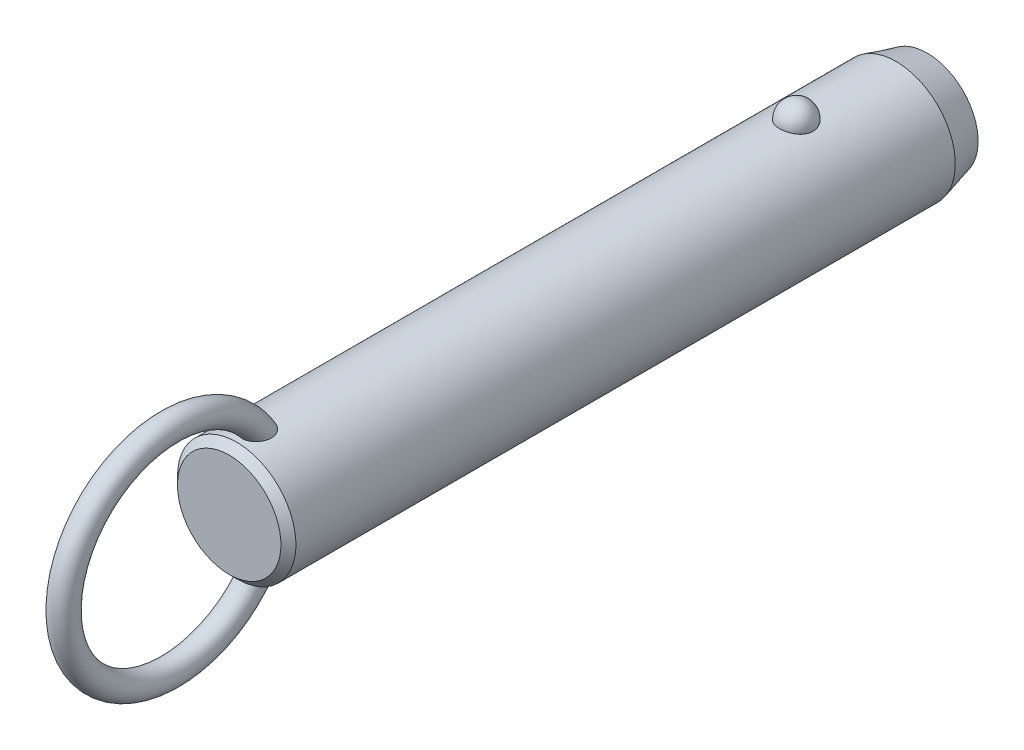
ISO-10303-21;
HEADER;
FILE_DESCRIPTION(('STEP AP214'),'2;1');
FILE_NAME('part.step','',(''),(''),'','','');
FILE_SCHEMA(('AUTOMOTIVE_DESIGN { 1 0 10303 214 1 1 1 1 }'));
ENDSEC;
DATA;
#1=APPLICATION_CONTEXT('core data for automotive mechanical design processes');
#2=APPLICATION_PROTOCOL_DEFINITION('international standard','automotive_design',2000,#1);
#3=PRODUCT_CONTEXT('',#1,'mechanical');
#4=PRODUCT('Part','Part','',(#3));
#5=PRODUCT_RELATED_PRODUCT_CATEGORY('part','',(#4));
#6=PRODUCT_DEFINITION_FORMATION('','',#4);
#7=PRODUCT_DEFINITION_CONTEXT('part definition',#1,'design');
#8=PRODUCT_DEFINITION('design','',#6,#7);
#9=PRODUCT_DEFINITION_SHAPE('','',#8);
#10=(LENGTH_UNIT() NAMED_UNIT(*) SI_UNIT(.MILLI.,.METRE.));
#11=(NAMED_UNIT(*) PLANE_ANGLE_UNIT() SI_UNIT($,.RADIAN.));
#12=(NAMED_UNIT(*) SI_UNIT($,.STERADIAN.) SOLID_ANGLE_UNIT());
#13=UNCERTAINTY_MEASURE_WITH_UNIT(LENGTH_MEASURE(1.E-05),#10,'distance_accuracy_value','');
#14=(GEOMETRIC_REPRESENTATION_CONTEXT(3) GLOBAL_UNCERTAINTY_ASSIGNED_CONTEXT((#13)) GLOBAL_UNIT_ASSIGNED_CONTEXT((#10,
#11,#12)) REPRESENTATION_CONTEXT('',''));
#15=CARTESIAN_POINT('',(0.,0.,0.));
#16=DIRECTION('',(0.,0.,1.));
#17=DIRECTION('',(1.,0.,0.));
#18=AXIS2_PLACEMENT_3D('',#15,#16,#17);
#19=CARTESIAN_POINT('',(0.,0.,78.8));
#20=DIRECTION('',(0.,0.,-1.));
#21=DIRECTION('',(-1.,0.,0.));
#22=AXIS2_PLACEMENT_3D('',#19,#20,#21);
#23=CYLINDRICAL_SURFACE('',#22,9.5);
#24=CARTESIAN_POINT('',(2.67259918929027,9.11631578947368,-2.7));
#25=CARTESIAN_POINT('',(2.6725968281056,9.11631786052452,-2.54909854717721));
#26=CARTESIAN_POINT('',(2.66030567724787,9.11994722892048,-2.39816735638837));
#27=CARTESIAN_POINT('',(2.6114347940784,9.13405924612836,-2.10058568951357));
#28=CARTESIAN_POINT('',(2.57484658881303,9.14454428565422,-1.9539367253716));
#29=CARTESIAN_POINT('',(2.47830875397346,9.17117631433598,-1.66916069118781));
#30=CARTESIAN_POINT('',(2.41836936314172,9.18732082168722,-1.53102991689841));
#31=CARTESIAN_POINT('',(2.27661331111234,9.22346780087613,-1.26705393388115));
#32=CARTESIAN_POINT('',(2.19479699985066,9.24347021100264,-1.14120852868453));
#33=CARTESIAN_POINT('',(2.01085282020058,9.28522401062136,-0.904632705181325));
#34=CARTESIAN_POINT('',(1.90862396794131,9.30698376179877,-0.793982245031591));
#35=CARTESIAN_POINT('',(1.6867437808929,9.34973971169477,-0.59160721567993));
#36=CARTESIAN_POINT('',(1.56709244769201,9.37073591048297,-0.499882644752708));
#37=CARTESIAN_POINT('',(1.31393976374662,9.40956370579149,-0.338167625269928));
#38=CARTESIAN_POINT('',(1.18048026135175,9.42740444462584,-0.268113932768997));
#39=CARTESIAN_POINT('',(0.903154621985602,9.45799906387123,-0.151390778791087));
#40=CARTESIAN_POINT('',(0.759289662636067,9.47075351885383,-0.104718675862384));
#41=CARTESIAN_POINT('',(0.468074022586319,9.48956256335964,-0.0367633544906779));
#42=CARTESIAN_POINT('',(0.320836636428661,9.49573643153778,-0.0150275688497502));
#43=CARTESIAN_POINT('',(0.0246714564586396,9.50112183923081,0.00396199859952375));
#44=CARTESIAN_POINT('',(-0.124256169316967,9.50033406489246,0.00121819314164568));
#45=CARTESIAN_POINT('',(-0.417264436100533,9.4919475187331,-0.0284441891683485));
#46=CARTESIAN_POINT('',(-0.561384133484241,9.48444885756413,-0.0550074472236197));
#47=CARTESIAN_POINT('',(-0.842986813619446,9.46357853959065,-0.131064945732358));
#48=CARTESIAN_POINT('',(-0.98046968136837,9.450206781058,-0.180559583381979));
#49=CARTESIAN_POINT('',(-1.24585005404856,9.41890822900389,-0.301476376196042));
#50=CARTESIAN_POINT('',(-1.37368611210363,9.40095498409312,-0.373026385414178));
#51=CARTESIAN_POINT('',(-1.61552738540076,9.3624296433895,-0.536025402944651));
#52=CARTESIAN_POINT('',(-1.72953116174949,9.34185727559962,-0.62747647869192));
#53=CARTESIAN_POINT('',(-1.9429225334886,9.29984568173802,-0.829844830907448));
#54=CARTESIAN_POINT('',(-2.04198021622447,9.27839736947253,-0.941108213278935));
#55=CARTESIAN_POINT('',(-2.2202646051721,9.23735994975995,-1.17883414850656));
#56=CARTESIAN_POINT('',(-2.29948985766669,9.21777097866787,-1.30529781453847));
#57=CARTESIAN_POINT('',(-2.43697287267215,9.18238994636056,-1.57158566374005));
#58=CARTESIAN_POINT('',(-2.49497068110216,9.16664569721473,-1.71155057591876));
#59=CARTESIAN_POINT('',(-2.5872073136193,9.14104303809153,-1.99961197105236));
#60=CARTESIAN_POINT('',(-2.62144683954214,9.13118445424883,-2.14770821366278));
#61=CARTESIAN_POINT('',(-2.66521466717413,9.11850622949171,-2.44715424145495));
#62=CARTESIAN_POINT('',(-2.67484831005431,9.11565658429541,-2.59848735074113));
#63=CARTESIAN_POINT('',(-2.66946735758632,9.11723375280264,-2.90067317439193));
#64=CARTESIAN_POINT('',(-2.65445345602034,9.12166036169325,-3.05152590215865));
#65=CARTESIAN_POINT('',(-2.6002971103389,9.13724422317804,-3.34766110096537));
#66=CARTESIAN_POINT('',(-2.56127978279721,9.14836656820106,-3.49296833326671));
#67=CARTESIAN_POINT('',(-2.46018844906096,9.17606676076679,-3.77477535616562));
#68=CARTESIAN_POINT('',(-2.39811349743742,9.19264483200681,-3.9112747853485));
#69=CARTESIAN_POINT('',(-2.25202303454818,9.22952198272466,-4.17244273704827));
#70=CARTESIAN_POINT('',(-2.16788714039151,9.24984129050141,-4.29704106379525));
#71=CARTESIAN_POINT('',(-1.9799408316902,9.29188255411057,-4.53013066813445));
#72=CARTESIAN_POINT('',(-1.87612963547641,9.31360456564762,-4.63862130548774));
#73=CARTESIAN_POINT('',(-1.65105429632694,9.35612959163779,-4.8369029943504));
#74=CARTESIAN_POINT('',(-1.52972405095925,9.37692871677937,-4.92661991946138));
#75=CARTESIAN_POINT('',(-1.27318250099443,9.41518970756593,-5.08429106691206));
#76=CARTESIAN_POINT('',(-1.13797219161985,9.432651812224,-5.15224684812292));
#77=CARTESIAN_POINT('',(-0.859280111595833,9.46208255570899,-5.26371827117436));
#78=CARTESIAN_POINT('',(-0.715925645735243,9.47411833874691,-5.30753421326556));
#79=CARTESIAN_POINT('',(-0.423550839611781,9.4916822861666,-5.37076321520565));
#80=CARTESIAN_POINT('',(-0.274531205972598,9.49721125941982,-5.39017930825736));
#81=CARTESIAN_POINT('',(0.0218446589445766,9.50110860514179,-5.40390587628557));
#82=CARTESIAN_POINT('',(0.169177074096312,9.49961381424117,-5.39869609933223));
#83=CARTESIAN_POINT('',(0.460808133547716,9.48993906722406,-5.3644195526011));
#84=CARTESIAN_POINT('',(0.605106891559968,9.48175936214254,-5.33535367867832));
#85=CARTESIAN_POINT('',(0.886027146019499,9.4596376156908,-5.2543558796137));
#86=CARTESIAN_POINT('',(1.02267710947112,9.44571881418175,-5.20251612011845));
#87=CARTESIAN_POINT('',(1.28523827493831,9.41358993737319,-5.07741549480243));
#88=CARTESIAN_POINT('',(1.41114877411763,9.39537958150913,-5.0041532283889));
#89=CARTESIAN_POINT('',(1.65085227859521,9.3562644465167,-4.83684599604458));
#90=CARTESIAN_POINT('',(1.76442346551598,9.33532178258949,-4.74249218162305));
#91=CARTESIAN_POINT('',(1.97425672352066,9.29321198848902,-4.53620389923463));
#92=CARTESIAN_POINT('',(2.07051582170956,9.27204482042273,-4.42426641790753));
#93=CARTESIAN_POINT('',(2.24490086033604,9.23139221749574,-4.18363183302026));
#94=CARTESIAN_POINT('',(2.32267019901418,9.21194380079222,-4.05466990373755));
#95=CARTESIAN_POINT('',(2.45584092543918,9.1773419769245,-3.78517836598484));
#96=CARTESIAN_POINT('',(2.51124979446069,9.16218713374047,-3.64465264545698));
#97=CARTESIAN_POINT('',(2.59380876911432,9.13913522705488,-3.37104301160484));
#98=CARTESIAN_POINT('',(2.62330266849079,9.13064624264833,-3.23871053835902));
#99=CARTESIAN_POINT('',(2.66269870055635,9.11923566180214,-2.97092664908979));
#100=CARTESIAN_POINT('',(2.67260130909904,9.11631393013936,-2.8354753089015));
#101=CARTESIAN_POINT('',(2.67259918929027,9.11631578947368,-2.7));
#102=B_SPLINE_CURVE_WITH_KNOTS('',3,(#24,#25,#26,#27,#28,#29,#30,#31,#32,#33,#34,#35,#36,#37,
#38,#39,#40,#41,#42,#43,#44,#45,#46,#47,#48,#49,#50,#51,#52,#53,#54,#55,#56,#57,#58,#59,#60,#61,
#62,#63,#64,#65,#66,#67,#68,#69,#70,#71,#72,#73,#74,#75,#76,#77,#78,#79,#80,#81,#82,#83,#84,#85,
#86,#87,#88,#89,#90,#91,#92,#93,#94,#95,#96,#97,#98,#99,#100,#101),.UNSPECIFIED.,.T.,.F.,(4,2,2,
2,2,2,2,2,2,2,2,2,2,2,2,2,2,2,2,2,2,2,2,2,2,2,2,2,2,2,2,2,2,2,2,2,2,2,4),(0.,0.452217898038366,
0.904593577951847,1.35677112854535,1.80894144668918,2.26340676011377,2.71787203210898,
3.17099820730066,3.62407318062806,4.0687883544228,4.51345969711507,4.95160616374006,
5.38976021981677,5.83050358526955,6.27129275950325,6.72071308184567,7.17016633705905,
7.62495278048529,8.07972578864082,8.53254856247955,8.98535859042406,9.43582813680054,
9.88631615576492,10.3393155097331,10.7923328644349,11.2471065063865,11.7018475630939,
12.1507959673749,12.5996885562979,13.0398725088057,13.4800399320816,13.9184421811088,
14.3568730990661,14.802202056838,15.2476074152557,15.7010097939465,16.1542603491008,
16.5602594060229,16.9662486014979),.UNSPECIFIED.);
#103=CARTESIAN_POINT('',(2.67259918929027,9.11631578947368,-2.7));
#104=VERTEX_POINT('',#103);
#105=EDGE_CURVE('E41',#104,#104,#102,.T.);
#106=ORIENTED_EDGE('',*,*,#105,.T.);
#107=EDGE_LOOP('',(#106));
#108=FACE_BOUND('',#107,.T.);
#109=CARTESIAN_POINT('',(0.,0.,87.12));
#110=DIRECTION('',(0.,0.,1.));
#111=DIRECTION('',(1.,0.,0.));
#112=AXIS2_PLACEMENT_3D('',#109,#110,#111);
#113=CIRCLE('',#112,9.5);
#114=CARTESIAN_POINT('',(-9.50000000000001,0.,87.12));
#115=VERTEX_POINT('',#114);
#116=EDGE_CURVE('E10',#115,#115,#113,.F.);
#117=ORIENTED_EDGE('',*,*,#116,.T.);
#118=EDGE_LOOP('',(#117));
#119=FACE_BOUND('',#118,.T.);
#120=CARTESIAN_POINT('',(-0.697062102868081,-9.47439269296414,81.4678088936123));
#121=CARTESIAN_POINT('',(-0.799579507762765,-9.46685146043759,81.5074823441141));
#122=CARTESIAN_POINT('',(-0.898575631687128,-9.45788043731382,81.5559309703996));
#123=CARTESIAN_POINT('',(-1.08670047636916,-9.43811593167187,81.6688685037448));
#124=CARTESIAN_POINT('',(-1.17583204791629,-9.42732297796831,81.7333527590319));
#125=CARTESIAN_POINT('',(-1.34179806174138,-9.40513672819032,81.8762099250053));
#126=CARTESIAN_POINT('',(-1.41865133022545,-9.39374438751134,81.954561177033));
#127=CARTESIAN_POINT('',(-1.5586004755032,-9.37154196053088,82.1227524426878));
#128=CARTESIAN_POINT('',(-1.62169476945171,-9.3607319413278,82.2125937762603));
#129=CARTESIAN_POINT('',(-1.73527695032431,-9.34035749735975,82.4045001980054));
#130=CARTESIAN_POINT('',(-1.7852226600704,-9.33085270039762,82.5068910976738));
#131=CARTESIAN_POINT('',(-1.86924997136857,-9.3143834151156,82.718148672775));
#132=CARTESIAN_POINT('',(-1.90332570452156,-9.30741986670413,82.8270177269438));
#133=CARTESIAN_POINT('',(-1.95893603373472,-9.29588482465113,83.0604730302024));
#134=CARTESIAN_POINT('',(-1.97872420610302,-9.29165182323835,83.1854890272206));
#135=CARTESIAN_POINT('',(-2.00062129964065,-9.28695978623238,83.4370805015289));
#136=CARTESIAN_POINT('',(-2.00272284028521,-9.28650232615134,83.563656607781));
#137=CARTESIAN_POINT('',(-1.98958876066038,-9.28932750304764,83.8368157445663));
#138=CARTESIAN_POINT('',(-1.97143366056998,-9.2932400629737,83.9832519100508));
#139=CARTESIAN_POINT('',(-1.91479925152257,-9.30507151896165,84.2720629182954));
#140=CARTESIAN_POINT('',(-1.87629122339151,-9.31299607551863,84.414431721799));
#141=CARTESIAN_POINT('',(-1.77225683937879,-9.33340232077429,84.7151725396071));
#142=CARTESIAN_POINT('',(-1.70334898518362,-9.34641636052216,84.8723691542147));
#143=CARTESIAN_POINT('',(-1.58111062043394,-9.36759153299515,85.0975171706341));
#144=CARTESIAN_POINT('',(-1.53721459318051,-9.37492619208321,85.1707968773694));
#145=CARTESIAN_POINT('',(-1.44302631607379,-9.38988566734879,85.3130740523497));
#146=CARTESIAN_POINT('',(-1.39273721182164,-9.39751033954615,85.3820736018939));
#147=CARTESIAN_POINT('',(-1.26775962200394,-9.41530678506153,85.5369832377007));
#148=CARTESIAN_POINT('',(-1.19052326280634,-9.42548108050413,85.6208712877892));
#149=CARTESIAN_POINT('',(-1.0242024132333,-9.44499825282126,85.7760086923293));
#150=CARTESIAN_POINT('',(-0.935139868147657,-9.45434261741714,85.8472808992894));
#151=CARTESIAN_POINT('',(-0.766610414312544,-9.46930670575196,85.9586955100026));
#152=CARTESIAN_POINT('',(-0.689439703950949,-9.47529223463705,86.0022354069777));
#153=CARTESIAN_POINT('',(-0.528942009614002,-9.48560294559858,86.0763133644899));
#154=CARTESIAN_POINT('',(-0.445620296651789,-9.48992953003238,86.1068624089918));
#155=CARTESIAN_POINT('',(-0.273901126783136,-9.49644161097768,86.1525792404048));
#156=CARTESIAN_POINT('',(-0.185465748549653,-9.49860811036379,86.16761059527));
#157=CARTESIAN_POINT('',(-0.00734541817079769,-9.5004135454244,86.1801494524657));
#158=CARTESIAN_POINT('',(0.0823387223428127,-9.50005405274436,86.1776678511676));
#159=CARTESIAN_POINT('',(0.247679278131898,-9.49708301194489,86.1569959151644));
#160=CARTESIAN_POINT('',(0.32362017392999,-9.49477609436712,86.1409300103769));
#161=CARTESIAN_POINT('',(0.47198153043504,-9.48855917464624,86.0971726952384));
#162=CARTESIAN_POINT('',(0.544400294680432,-9.48464840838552,86.0694757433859));
#163=CARTESIAN_POINT('',(0.708947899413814,-9.47398336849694,85.9928026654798));
#164=CARTESIAN_POINT('',(0.799149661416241,-9.46671310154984,85.9397745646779));
#165=CARTESIAN_POINT('',(0.969783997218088,-9.45076225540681,85.8199731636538));
#166=CARTESIAN_POINT('',(1.05019415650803,-9.44207854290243,85.7531692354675));
#167=CARTESIAN_POINT('',(1.23092343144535,-9.42051459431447,85.5807596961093));
#168=CARTESIAN_POINT('',(1.32652499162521,-9.40733378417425,85.4702619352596));
#169=CARTESIAN_POINT('',(1.49893121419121,-9.38140745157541,85.2355614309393));
#170=CARTESIAN_POINT('',(1.57571616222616,-9.36866239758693,85.1113445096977));
#171=CARTESIAN_POINT('',(1.71285426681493,-9.34457644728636,84.8493891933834));
#172=CARTESIAN_POINT('',(1.77266365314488,-9.33328726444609,84.7113623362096));
#173=CARTESIAN_POINT('',(1.87239208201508,-9.31379209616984,84.4280515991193));
#174=CARTESIAN_POINT('',(1.91230158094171,-9.3055875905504,84.282764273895));
#175=CARTESIAN_POINT('',(1.9760418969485,-9.29228394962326,83.9620281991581));
#176=CARTESIAN_POINT('',(1.99587438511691,-9.28797202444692,83.7857248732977));
#177=CARTESIAN_POINT('',(2.0029570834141,-9.28645519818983,83.4324146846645));
#178=CARTESIAN_POINT('',(1.99025930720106,-9.28923895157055,83.2554093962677));
#179=CARTESIAN_POINT('',(1.93735479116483,-9.30038134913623,82.9563381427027));
#180=CARTESIAN_POINT('',(1.90576827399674,-9.30697680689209,82.8326679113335));
#181=CARTESIAN_POINT('',(1.82287484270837,-9.32356855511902,82.592329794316));
#182=CARTESIAN_POINT('',(1.77158213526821,-9.33356239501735,82.4756569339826));
#183=CARTESIAN_POINT('',(1.6488574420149,-9.35602275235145,82.2527061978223));
#184=CARTESIAN_POINT('',(1.57730995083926,-9.36850332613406,82.1464927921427));
#185=CARTESIAN_POINT('',(1.41543264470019,-9.39431873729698,81.9495530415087));
#186=CARTESIAN_POINT('',(1.32510883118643,-9.40765330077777,81.8588217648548));
#187=CARTESIAN_POINT('',(1.13846223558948,-9.43195720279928,81.7050334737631));
#188=CARTESIAN_POINT('',(1.0436989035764,-9.44302894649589,81.6400947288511));
#189=CARTESIAN_POINT('',(0.843965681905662,-9.46296805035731,81.5280388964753));
#190=CARTESIAN_POINT('',(0.739000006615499,-9.47183631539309,81.4809144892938));
#191=CARTESIAN_POINT('',(0.528175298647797,-9.48586140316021,81.4081173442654));
#192=CARTESIAN_POINT('',(0.422686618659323,-9.49119633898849,81.3814024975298));
#193=CARTESIAN_POINT('',(0.208590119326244,-9.49831365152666,81.3460137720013));
#194=CARTESIAN_POINT('',(0.0999817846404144,-9.500095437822,81.3373428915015));
#195=CARTESIAN_POINT('',(-0.126104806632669,-9.49988861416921,81.3383501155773));
#196=CARTESIAN_POINT('',(-0.243578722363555,-9.49757821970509,81.3495942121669));
#197=CARTESIAN_POINT('',(-0.474390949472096,-9.48885165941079,81.393167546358));
#198=CARTESIAN_POINT('',(-0.587729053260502,-9.48243528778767,81.4254978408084));
#199=CARTESIAN_POINT('',(-0.697062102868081,-9.47439269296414,81.4678088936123));
#200=B_SPLINE_CURVE_WITH_KNOTS('',3,(#120,#121,#122,#123,#124,#125,#126,#127,#128,#129,#130,
#131,#132,#133,#134,#135,#136,#137,#138,#139,#140,#141,#142,#143,#144,#145,#146,#147,#148,#149,
#150,#151,#152,#153,#154,#155,#156,#157,#158,#159,#160,#161,#162,#163,#164,#165,#166,#167,#168,
#169,#170,#171,#172,#173,#174,#175,#176,#177,#178,#179,#180,#181,#182,#183,#184,#185,#186,#187,
#188,#189,#190,#191,#192,#193,#194,#195,#196,#197,#198,#199),.UNSPECIFIED.,.T.,.F.,(4,2,2,2,2,2,
2,2,2,2,2,2,2,2,2,2,2,2,2,2,2,2,2,2,2,2,2,2,2,2,2,2,2,2,2,2,2,2,2,4),(0.,0.330119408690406,
0.660143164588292,0.989655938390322,1.31920659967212,1.66074728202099,2.00241415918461,
2.38088696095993,2.75951768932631,3.20065679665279,3.6424200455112,4.15620996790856,
4.41314162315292,4.66994734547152,5.0122866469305,5.35399933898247,5.6194303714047,
5.88463652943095,6.15215502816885,6.41950709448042,6.65144391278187,6.88349136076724,
7.19641200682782,7.51003602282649,7.9477971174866,8.38601491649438,8.83699707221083,
9.28819530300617,9.8177866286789,10.3465317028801,10.7284172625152,11.110028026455,
11.4938603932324,11.8775702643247,12.2220189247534,12.5663259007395,12.8915939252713,
13.2169159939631,13.5689650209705,13.9210316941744),.UNSPECIFIED.);
#201=CARTESIAN_POINT('',(-0.697062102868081,-9.47439269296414,81.4678088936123));
#202=VERTEX_POINT('',#201);
#203=EDGE_CURVE('E60',#202,#202,#200,.T.);
#204=ORIENTED_EDGE('',*,*,#203,.T.);
#205=EDGE_LOOP('',(#204));
#206=FACE_BOUND('',#205,.T.);
#207=CARTESIAN_POINT('',(-0.697062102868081,9.47439269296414,81.4678088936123));
#208=CARTESIAN_POINT('',(-0.597792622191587,9.48169483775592,81.4293956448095));
#209=CARTESIAN_POINT('',(-0.495106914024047,9.48766580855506,81.3991682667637));
#210=CARTESIAN_POINT('',(-0.285876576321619,9.49627648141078,81.3560327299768));
#211=CARTESIAN_POINT('',(-0.179324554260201,9.49890941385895,81.3431597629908));
#212=CARTESIAN_POINT('',(0.0344157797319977,9.50053798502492,81.3351666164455));
#213=CARTESIAN_POINT('',(0.141603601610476,9.49953613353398,81.3400341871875));
#214=CARTESIAN_POINT('',(0.353563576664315,9.49401038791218,81.3673654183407));
#215=CARTESIAN_POINT('',(0.45833679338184,9.48948807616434,81.38982117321));
#216=CARTESIAN_POINT('',(0.662493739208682,9.4774236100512,81.4516719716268));
#217=CARTESIAN_POINT('',(0.761881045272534,9.46988348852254,81.4910556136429));
#218=CARTESIAN_POINT('',(0.952608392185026,9.45260382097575,81.5856342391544));
#219=CARTESIAN_POINT('',(1.04394806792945,9.44286417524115,81.6408299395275));
#220=CARTESIAN_POINT('',(1.21712767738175,9.4221176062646,81.7660662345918));
#221=CARTESIAN_POINT('',(1.29885671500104,9.41109835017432,81.8362579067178));
#222=CARTESIAN_POINT('',(1.44978975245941,9.38903310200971,81.988980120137));
#223=CARTESIAN_POINT('',(1.51899278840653,9.37798710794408,82.0715116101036));
#224=CARTESIAN_POINT('',(1.64602857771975,9.35654375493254,82.2497763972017));
#225=CARTESIAN_POINT('',(1.70333052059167,9.34618688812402,82.3458916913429));
#226=CARTESIAN_POINT('',(1.80259341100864,9.32755128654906,82.545897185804));
#227=CARTESIAN_POINT('',(1.84454942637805,9.31927322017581,82.6497898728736));
#228=CARTESIAN_POINT('',(1.91637039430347,9.30478365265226,82.8722131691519));
#229=CARTESIAN_POINT('',(1.944805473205,9.29882552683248,82.9912192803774));
#230=CARTESIAN_POINT('',(1.98449865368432,9.29043398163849,83.2321436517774));
#231=CARTESIAN_POINT('',(1.99574908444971,9.28800213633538,83.3540631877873));
#232=CARTESIAN_POINT('',(2.00275141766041,9.28649645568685,83.6169324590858));
#233=CARTESIAN_POINT('',(1.99588238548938,9.28799035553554,83.7579529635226));
#234=CARTESIAN_POINT('',(1.96270559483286,9.29505517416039,84.0376217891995));
#235=CARTESIAN_POINT('',(1.93637872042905,9.30063010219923,84.176267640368));
#236=CARTESIAN_POINT('',(1.85949176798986,9.31633564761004,84.4725616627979));
#237=CARTESIAN_POINT('',(1.80549792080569,9.3270926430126,84.6292907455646));
#238=CARTESIAN_POINT('',(1.67376869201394,9.35163064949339,84.9322840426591));
#239=CARTESIAN_POINT('',(1.59603181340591,9.36541185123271,85.0785475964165));
#240=CARTESIAN_POINT('',(1.4360277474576,9.39110706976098,85.3258138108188));
#241=CARTESIAN_POINT('',(1.35831795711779,9.40278656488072,85.429791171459));
#242=CARTESIAN_POINT('',(1.18774483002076,9.42585025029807,85.6245347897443));
#243=CARTESIAN_POINT('',(1.09490932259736,9.43723493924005,85.7153247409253));
#244=CARTESIAN_POINT('',(0.921110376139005,9.45552616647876,85.8562033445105));
#245=CARTESIAN_POINT('',(0.843738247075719,9.46281058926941,85.9106563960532));
#246=CARTESIAN_POINT('',(0.68124519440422,9.47589120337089,86.0067117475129));
#247=CARTESIAN_POINT('',(0.596135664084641,9.48168953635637,86.0483325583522));
#248=CARTESIAN_POINT('',(0.433779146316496,9.49038144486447,86.1100899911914));
#249=CARTESIAN_POINT('',(0.357459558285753,9.49359170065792,86.1326013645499));
#250=CARTESIAN_POINT('',(0.202074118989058,9.49816761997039,86.1645745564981));
#251=CARTESIAN_POINT('',(0.123010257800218,9.49953459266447,86.1740456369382));
#252=CARTESIAN_POINT('',(-0.0357372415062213,9.50026497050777,86.1791143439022));
#253=CARTESIAN_POINT('',(-0.115421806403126,9.49962433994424,86.1746840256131));
#254=CARTESIAN_POINT('',(-0.272823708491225,9.49640854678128,86.1522962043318));
#255=CARTESIAN_POINT('',(-0.350540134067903,9.4938325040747,86.1343325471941));
#256=CARTESIAN_POINT('',(-0.500580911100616,9.4870946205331,86.0868028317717));
#257=CARTESIAN_POINT('',(-0.572979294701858,9.48296359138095,86.0574618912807));
#258=CARTESIAN_POINT('',(-0.712864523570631,9.47347609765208,85.9890087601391));
#259=CARTESIAN_POINT('',(-0.780349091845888,9.46811906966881,85.9498920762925));
#260=CARTESIAN_POINT('',(-0.94630921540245,9.45329720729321,85.839432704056));
#261=CARTESIAN_POINT('',(-1.04090230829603,9.44321512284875,85.7623297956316));
#262=CARTESIAN_POINT('',(-1.21661929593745,9.42219227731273,85.5940971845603));
#263=CARTESIAN_POINT('',(-1.2977051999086,9.41124921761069,85.5029292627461));
#264=CARTESIAN_POINT('',(-1.47319646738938,9.38563439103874,85.2761621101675));
#265=CARTESIAN_POINT('',(-1.56208878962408,9.37102009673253,85.1362895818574));
#266=CARTESIAN_POINT('',(-1.71623987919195,9.34401559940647,84.8439503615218));
#267=CARTESIAN_POINT('',(-1.78147866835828,9.33162728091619,84.691473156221));
#268=CARTESIAN_POINT('',(-1.88853837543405,9.31055541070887,84.3756470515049));
#269=CARTESIAN_POINT('',(-1.92998995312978,9.30193076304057,84.2121685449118));
#270=CARTESIAN_POINT('',(-1.98590726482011,9.29015757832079,83.8805268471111));
#271=CARTESIAN_POINT('',(-2.0004070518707,9.2870021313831,83.7123698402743));
#272=CARTESIAN_POINT('',(-1.99964701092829,9.28716218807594,83.4050806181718));
#273=CARTESIAN_POINT('',(-1.98908145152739,9.28945704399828,83.2659362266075));
#274=CARTESIAN_POINT('',(-1.94566294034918,9.29865169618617,82.9911539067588));
#275=CARTESIAN_POINT('',(-1.9128206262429,9.30554929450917,82.855514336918));
#276=CARTESIAN_POINT('',(-1.84582133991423,9.31898248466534,82.6578026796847));
#277=CARTESIAN_POINT('',(-1.82038084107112,9.32400364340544,82.592583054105));
#278=CARTESIAN_POINT('',(-1.76350511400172,9.33492884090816,82.4649033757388));
#279=CARTESIAN_POINT('',(-1.73207305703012,9.34083241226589,82.4024418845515));
#280=CARTESIAN_POINT('',(-1.66324243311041,9.35333332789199,82.2809407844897));
#281=CARTESIAN_POINT('',(-1.62584239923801,9.35993084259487,82.221902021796));
#282=CARTESIAN_POINT('',(-1.54527678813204,9.37356864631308,82.1079875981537));
#283=CARTESIAN_POINT('',(-1.50211241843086,9.38060884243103,82.0531110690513));
#284=CARTESIAN_POINT('',(-1.3768114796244,9.40004442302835,81.909961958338));
#285=CARTESIAN_POINT('',(-1.28916358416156,9.41261047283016,81.8264295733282));
#286=CARTESIAN_POINT('',(-1.09996826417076,9.43658180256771,81.6772360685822));
#287=CARTESIAN_POINT('',(-0.998461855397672,9.44799034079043,81.6115238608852));
#288=CARTESIAN_POINT('',(-0.860188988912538,9.46103017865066,81.5394367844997));
#289=CARTESIAN_POINT('',(-0.828141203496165,9.46389141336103,81.5238511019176));
#290=CARTESIAN_POINT('',(-0.763210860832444,9.46934915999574,81.4944734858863));
#291=CARTESIAN_POINT('',(-0.73032830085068,9.47194567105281,81.4806815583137));
#292=CARTESIAN_POINT('',(-0.697062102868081,9.47439269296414,81.4678088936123));
#293=B_SPLINE_CURVE_WITH_KNOTS('',3,(#207,#208,#209,#210,#211,#212,#213,#214,#215,#216,#217,
#218,#219,#220,#221,#222,#223,#224,#225,#226,#227,#228,#229,#230,#231,#232,#233,#234,#235,#236,
#237,#238,#239,#240,#241,#242,#243,#244,#245,#246,#247,#248,#249,#250,#251,#252,#253,#254,#255,
#256,#257,#258,#259,#260,#261,#262,#263,#264,#265,#266,#267,#268,#269,#270,#271,#272,#273,#274,
#275,#276,#277,#278,#279,#280,#281,#282,#283,#284,#285,#286,#287,#288,#289,#290,#291,#292),
.UNSPECIFIED.,.T.,.F.,(4,2,2,2,2,2,2,2,2,2,2,2,2,2,2,2,2,2,2,2,2,2,2,2,2,2,2,2,2,2,2,2,2,2,2,2,
2,2,2,2,2,2,4),(0.,0.319942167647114,0.640532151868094,0.960900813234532,1.28112555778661,
1.60113495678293,1.92115886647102,2.24457323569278,2.56801248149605,2.90371927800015,
3.23953387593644,3.60560313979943,3.97183576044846,4.393836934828,4.81625324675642,
5.31257045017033,5.80891895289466,6.19868344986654,6.58773876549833,6.87145417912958,
7.15475838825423,7.3926375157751,7.63034760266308,7.86853584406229,8.10683246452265,
8.3406366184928,8.57454843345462,8.93983939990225,9.30614105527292,9.80266668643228,
10.2996107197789,10.8040753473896,11.3079021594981,11.7249776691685,12.1418541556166,
12.3521485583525,12.5623319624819,12.7725671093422,12.9827582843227,13.345827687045,
13.7078449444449,13.8150604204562,13.9222762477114),.UNSPECIFIED.);
#294=CARTESIAN_POINT('',(-0.697062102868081,9.47439269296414,81.4678088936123));
#295=VERTEX_POINT('',#294);
#296=EDGE_CURVE('E67',#295,#295,#293,.T.);
#297=ORIENTED_EDGE('',*,*,#296,.T.);
#298=EDGE_LOOP('',(#297));
#299=FACE_BOUND('',#298,.T.);
#300=CARTESIAN_POINT('',(0.,0.,-18.6999999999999));
#301=DIRECTION('',(0.,0.,-1.));
#302=DIRECTION('',(-1.,0.,0.));
#303=AXIS2_PLACEMENT_3D('',#300,#301,#302);
#304=CIRCLE('',#303,9.5);
#305=CARTESIAN_POINT('',(-9.5,0.,-18.6999999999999));
#306=VERTEX_POINT('',#305);
#307=EDGE_CURVE('E57',#306,#306,#304,.F.);
#308=ORIENTED_EDGE('',*,*,#307,.T.);
#309=EDGE_LOOP('',(#308));
#310=FACE_BOUND('',#309,.T.);
#311=ADVANCED_FACE('F37',(#108,#119,#206,#299,#310),#23,.T.);
#312=CARTESIAN_POINT('',(0.,0.,-23.7));
#313=DIRECTION('',(0.,0.,-1.));
#314=DIRECTION('',(-1.,0.,0.));
#315=AXIS2_PLACEMENT_3D('',#312,#313,#314);
#316=PLANE('',#315);
#317=CARTESIAN_POINT('',(0.,0.,-23.7));
#318=DIRECTION('',(0.,0.,-1.));
#319=DIRECTION('',(-1.,0.,0.));
#320=AXIS2_PLACEMENT_3D('',#317,#318,#319);
#321=CIRCLE('',#320,8.16025403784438);
#322=CARTESIAN_POINT('',(-8.16025403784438,0.,-23.7));
#323=VERTEX_POINT('',#322);
#324=EDGE_CURVE('E66',#323,#323,#321,.T.);
#325=ORIENTED_EDGE('',*,*,#324,.T.);
#326=EDGE_LOOP('',(#325));
#327=FACE_BOUND('',#326,.T.);
#328=ADVANCED_FACE('F85',(#327),#316,.T.);
#329=CARTESIAN_POINT('',(0.,0.,-23.7));
#330=DIRECTION('',(0.,0.,1.));
#331=DIRECTION('',(1.,0.,0.));
#332=AXIS2_PLACEMENT_3D('',#329,#330,#331);
#333=CONICAL_SURFACE('',#332,8.16025403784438,0.261799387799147);
#334=ORIENTED_EDGE('',*,*,#307,.F.);
#335=EDGE_LOOP('',(#334));
#336=FACE_BOUND('',#335,.T.);
#337=ORIENTED_EDGE('',*,*,#324,.F.);
#338=EDGE_LOOP('',(#337));
#339=FACE_BOUND('',#338,.T.);
#340=ADVANCED_FACE('F83',(#336,#339),#333,.T.);
#341=CARTESIAN_POINT('',(0.,0.,88.32));
#342=DIRECTION('',(0.,0.,1.));
#343=DIRECTION('',(1.,0.,0.));
#344=AXIS2_PLACEMENT_3D('',#341,#342,#343);
#345=PLANE('',#344);
#346=CARTESIAN_POINT('',(0.,0.,88.32));
#347=DIRECTION('',(0.,0.,1.));
#348=DIRECTION('',(1.,0.,0.));
#349=AXIS2_PLACEMENT_3D('',#346,#347,#348);
#350=CIRCLE('',#349,8.29999999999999);
#351=CARTESIAN_POINT('',(-8.3,0.,88.32));
#352=VERTEX_POINT('',#351);
#353=EDGE_CURVE('E50',#352,#352,#350,.T.);
#354=ORIENTED_EDGE('',*,*,#353,.T.);
#355=EDGE_LOOP('',(#354));
#356=FACE_BOUND('',#355,.T.);
#357=ADVANCED_FACE('F77',(#356),#345,.T.);
#358=CARTESIAN_POINT('',(0.,0.,97.85));
#359=DIRECTION('',(1.,0.,0.));
#360=DIRECTION('',(0.,0.,-1.));
#361=AXIS2_PLACEMENT_3D('',#358,#359,#360);
#362=TOROIDAL_SURFACE('',#361,17.05,2.);
#363=ORIENTED_EDGE('',*,*,#296,.F.);
#364=EDGE_LOOP('',(#363));
#365=FACE_BOUND('',#364,.T.);
#366=ORIENTED_EDGE('',*,*,#203,.F.);
#367=EDGE_LOOP('',(#366));
#368=FACE_BOUND('',#367,.T.);
#369=ADVANCED_FACE('F73',(#365,#368),#362,.T.);
#370=CARTESIAN_POINT('',(0.,0.,88.32));
#371=DIRECTION('',(0.,0.,-1.));
#372=DIRECTION('',(-1.,0.,0.));
#373=AXIS2_PLACEMENT_3D('',#370,#371,#372);
#374=CONICAL_SURFACE('',#373,8.29999999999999,0.785398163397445);
#375=CARTESIAN_POINT('',(-9.50000000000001,0.,87.12));
#376=CARTESIAN_POINT('',(-9.48750000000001,0.,87.1325));
#377=CARTESIAN_POINT('',(-9.47500000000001,0.,87.145));
#378=CARTESIAN_POINT('',(-9.45000000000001,0.,87.17));
#379=CARTESIAN_POINT('',(-9.43750000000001,0.,87.1825));
#380=CARTESIAN_POINT('',(-9.41250000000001,0.,87.2075));
#381=CARTESIAN_POINT('',(-9.40000000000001,0.,87.22));
#382=CARTESIAN_POINT('',(-9.37500000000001,0.,87.245));
#383=CARTESIAN_POINT('',(-9.36250000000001,0.,87.2575));
#384=CARTESIAN_POINT('',(-9.3375,0.,87.2825));
#385=CARTESIAN_POINT('',(-9.325,0.,87.295));
#386=CARTESIAN_POINT('',(-9.3,0.,87.32));
#387=CARTESIAN_POINT('',(-9.2875,0.,87.3325));
#388=CARTESIAN_POINT('',(-9.26250000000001,0.,87.3575));
#389=CARTESIAN_POINT('',(-9.25000000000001,0.,87.37));
#390=CARTESIAN_POINT('',(-9.225,0.,87.395));
#391=CARTESIAN_POINT('',(-9.2125,0.,87.4075));
#392=CARTESIAN_POINT('',(-9.1875,0.,87.4325));
#393=CARTESIAN_POINT('',(-9.175,0.,87.445));
#394=CARTESIAN_POINT('',(-9.15000000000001,0.,87.47));
#395=CARTESIAN_POINT('',(-9.1375,0.,87.4825));
#396=CARTESIAN_POINT('',(-9.1125,0.,87.5075));
#397=CARTESIAN_POINT('',(-9.1,0.,87.52));
#398=CARTESIAN_POINT('',(-9.075,0.,87.545));
#399=CARTESIAN_POINT('',(-9.06250000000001,0.,87.5575));
#400=CARTESIAN_POINT('',(-9.0375,0.,87.5825));
#401=CARTESIAN_POINT('',(-9.025,0.,87.595));
#402=CARTESIAN_POINT('',(-9.,0.,87.62));
#403=CARTESIAN_POINT('',(-8.9875,0.,87.6325));
#404=CARTESIAN_POINT('',(-8.9625,0.,87.6575));
#405=CARTESIAN_POINT('',(-8.95,0.,87.67));
#406=CARTESIAN_POINT('',(-8.925,0.,87.695));
#407=CARTESIAN_POINT('',(-8.9125,0.,87.7075));
#408=CARTESIAN_POINT('',(-8.8875,0.,87.7325));
#409=CARTESIAN_POINT('',(-8.875,0.,87.745));
#410=CARTESIAN_POINT('',(-8.85,0.,87.77));
#411=CARTESIAN_POINT('',(-8.8375,0.,87.7825));
#412=CARTESIAN_POINT('',(-8.8125,0.,87.8075));
#413=CARTESIAN_POINT('',(-8.8,0.,87.82));
#414=CARTESIAN_POINT('',(-8.775,0.,87.845));
#415=CARTESIAN_POINT('',(-8.7625,0.,87.8575));
#416=CARTESIAN_POINT('',(-8.7375,0.,87.8825));
#417=CARTESIAN_POINT('',(-8.725,0.,87.895));
#418=CARTESIAN_POINT('',(-8.7,0.,87.92));
#419=CARTESIAN_POINT('',(-8.6875,0.,87.9325));
#420=CARTESIAN_POINT('',(-8.6625,0.,87.9575));
#421=CARTESIAN_POINT('',(-8.65,0.,87.97));
#422=CARTESIAN_POINT('',(-8.625,0.,87.995));
#423=CARTESIAN_POINT('',(-8.6125,0.,88.0075));
#424=CARTESIAN_POINT('',(-8.5875,0.,88.0325));
#425=CARTESIAN_POINT('',(-8.575,0.,88.045));
#426=CARTESIAN_POINT('',(-8.55,0.,88.07));
#427=CARTESIAN_POINT('',(-8.5375,0.,88.0825));
#428=CARTESIAN_POINT('',(-8.5125,0.,88.1075));
#429=CARTESIAN_POINT('',(-8.5,0.,88.12));
#430=CARTESIAN_POINT('',(-8.475,0.,88.145));
#431=CARTESIAN_POINT('',(-8.4625,0.,88.1575));
#432=CARTESIAN_POINT('',(-8.43749999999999,0.,88.1825));
#433=CARTESIAN_POINT('',(-8.425,0.,88.195));
#434=CARTESIAN_POINT('',(-8.4,0.,88.22));
#435=CARTESIAN_POINT('',(-8.3875,0.,88.2325));
#436=CARTESIAN_POINT('',(-8.3625,0.,88.2575));
#437=CARTESIAN_POINT('',(-8.35,0.,88.27));
#438=CARTESIAN_POINT('',(-8.32499999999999,0.,88.295));
#439=CARTESIAN_POINT('',(-8.31249999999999,0.,88.3075));
#440=CARTESIAN_POINT('',(-8.3,0.,88.32));
#441=B_SPLINE_CURVE_WITH_KNOTS('',3,(#375,#376,#377,#378,#379,#380,#381,#382,#383,#384,#385,
#386,#387,#388,#389,#390,#391,#392,#393,#394,#395,#396,#397,#398,#399,#400,#401,#402,#403,#404,
#405,#406,#407,#408,#409,#410,#411,#412,#413,#414,#415,#416,#417,#418,#419,#420,#421,#422,#423,
#424,#425,#426,#427,#428,#429,#430,#431,#432,#433,#434,#435,#436,#437,#438,#439,#440),
.UNSPECIFIED.,.F.,.F.,(4,2,2,2,2,2,2,2,2,2,2,2,2,2,2,2,2,2,2,2,2,2,2,2,2,2,2,2,2,2,2,2,4),(0.,
0.0530330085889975,0.106066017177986,0.159099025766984,0.212132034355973,0.265165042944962,
0.318198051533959,0.371231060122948,0.424264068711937,0.477297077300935,0.530330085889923,
0.583363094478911,0.63639610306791,0.689429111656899,0.742462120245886,0.795495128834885,
0.848528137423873,0.901561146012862,0.95459415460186,1.00762716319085,1.06066017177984,
1.11369318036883,1.16672618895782,1.21975919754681,1.27279220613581,1.3258252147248,
1.37885822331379,1.43189123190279,1.48492424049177,1.53795724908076,1.59099025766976,
1.64402326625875,1.69705627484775),.UNSPECIFIED.);
#442=EDGE_CURVE('BSEAM39',#115,#352,#441,.T.);
#443=ORIENTED_EDGE('',*,*,#116,.F.);
#444=ORIENTED_EDGE('',*,*,#353,.F.);
#445=ORIENTED_EDGE('',*,*,#442,.T.);
#446=ORIENTED_EDGE('',*,*,#442,.F.);
#447=EDGE_LOOP('',(#443,#445,#444,#446));
#448=FACE_BOUND('',#447,.T.);
#449=ADVANCED_FACE('F39',(#448),#374,.T.);
#450=CARTESIAN_POINT('',(0.,9.5,-2.7));
#451=DIRECTION('',(0.,1.,0.));
#452=DIRECTION('',(0.,0.,-1.));
#453=AXIS2_PLACEMENT_3D('',#450,#451,#452);
#454=SPHERICAL_SURFACE('',#453,2.7);
#455=ORIENTED_EDGE('',*,*,#105,.F.);
#456=EDGE_LOOP('',(#455));
#457=FACE_BOUND('',#456,.T.);
#458=ADVANCED_FACE('F79',(#457),#454,.T.);
#459=CLOSED_SHELL('',(#311,#328,#340,#357,#369,#449,#458));
#460=MANIFOLD_SOLID_BREP('B2',#459);
#461=ADVANCED_BREP_SHAPE_REPRESENTATION('',(#18,#460),#14);
#462=SHAPE_DEFINITION_REPRESENTATION(#9,#461);
ENDSEC;
END-ISO-10303-21;
